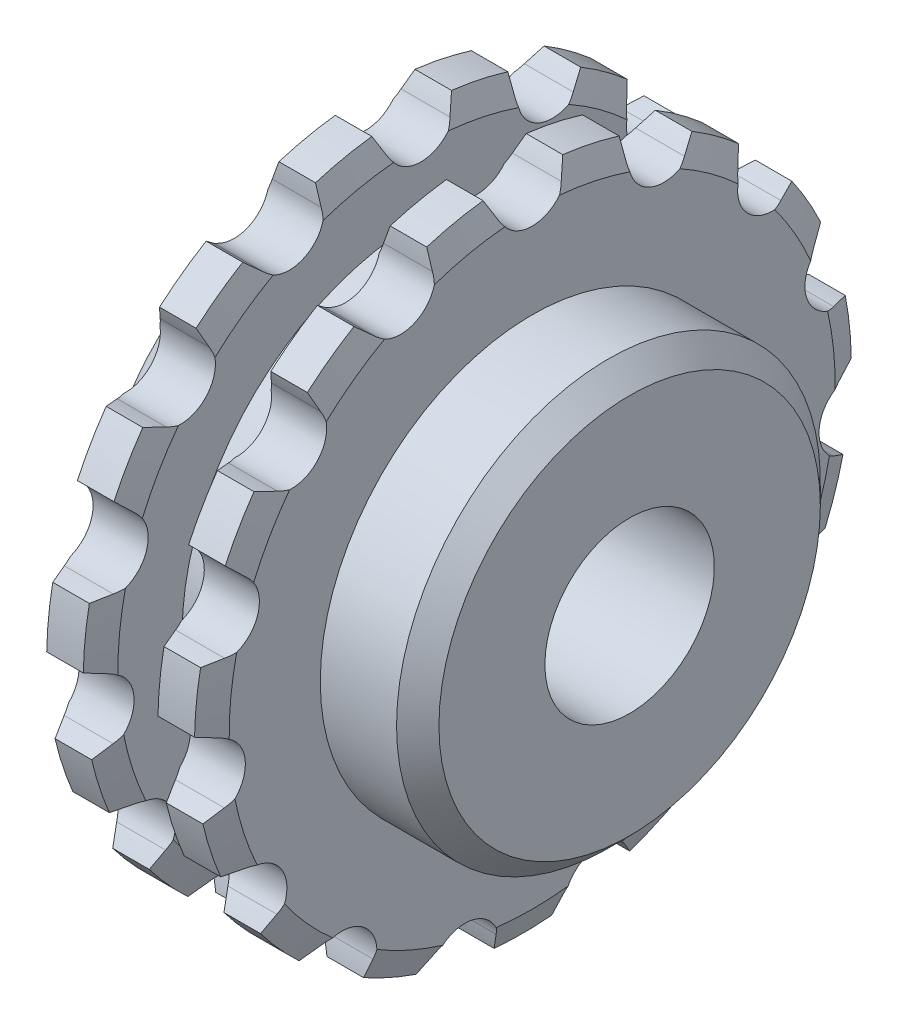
from build123d import *

# Parameters (mm, degrees)
DENTURE_DEPTH                = 25.707488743
R_P_TITION_CIRCULAIRE1_COUNT = 15


with BuildPart() as part:
    # Esquisse2 → Base-R_volution (revolve)
    with BuildSketch(Plane.XY, mode=Mode.PRIVATE) as base_r_volution_sk:
        Polygon((0, 4), (0, 9), (-1, 10), (-4.6, 10), (-4.6, 14.3), (-5.036764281, 15.5), (-6.763235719, 15.5), (-7.2, 14.3), (-7.2, 11.27), (-9.85, 11.27), (-9.85, 14.3), (-10.286764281, 15.5), (-12.013235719, 15.5), (-12.45, 14.3), (-12.45, 10), (-15, 10), (-16, 9), (-16, 4), align=None)
    revolve(base_r_volution_sk.sketch.rotate(Axis((-70.5, 0, 0), (1, 0, 0)), 90), axis=Axis((-70.5, 0, 0), (1, 0, 0)))

    # Esquisse4 → Denture (cut, through all)
    with BuildSketch(Plane(origin=(-4.6, 0, 0), x_dir=(0, 0, -1), z_dir=(1, 0, 0))):
        with BuildLine():
            ThreePointArc((-1.51730606, 14.622608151), (0, 13.6209), (1.51730606, 14.622608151))
            ThreePointArc((1.51730606, 14.622608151), (1.691246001, 15.007750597), (1.880763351, 15.385471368))
            ThreePointArc((1.880763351, 15.385471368), (0, 15.5), (-1.880763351, 15.385471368))
            ThreePointArc((-1.880763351, 15.385471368), (-1.691246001, 15.007750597), (-1.51730606, 14.622608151))
        make_face()
    denture = extrude(amount=-DENTURE_DEPTH, mode=Mode.SUBTRACT)

    # R_p_tition circulaire1: Denture ×15 about axis
    r_p_tition_circulaire1_axis = Axis((-70.5, 0, 0), (1, 0, 0))
    for i in range(1, R_P_TITION_CIRCULAIRE1_COUNT):
        add(denture.rotate(r_p_tition_circulaire1_axis, i * 360 / R_P_TITION_CIRCULAIRE1_COUNT), mode=Mode.SUBTRACT)


solid = part.part
